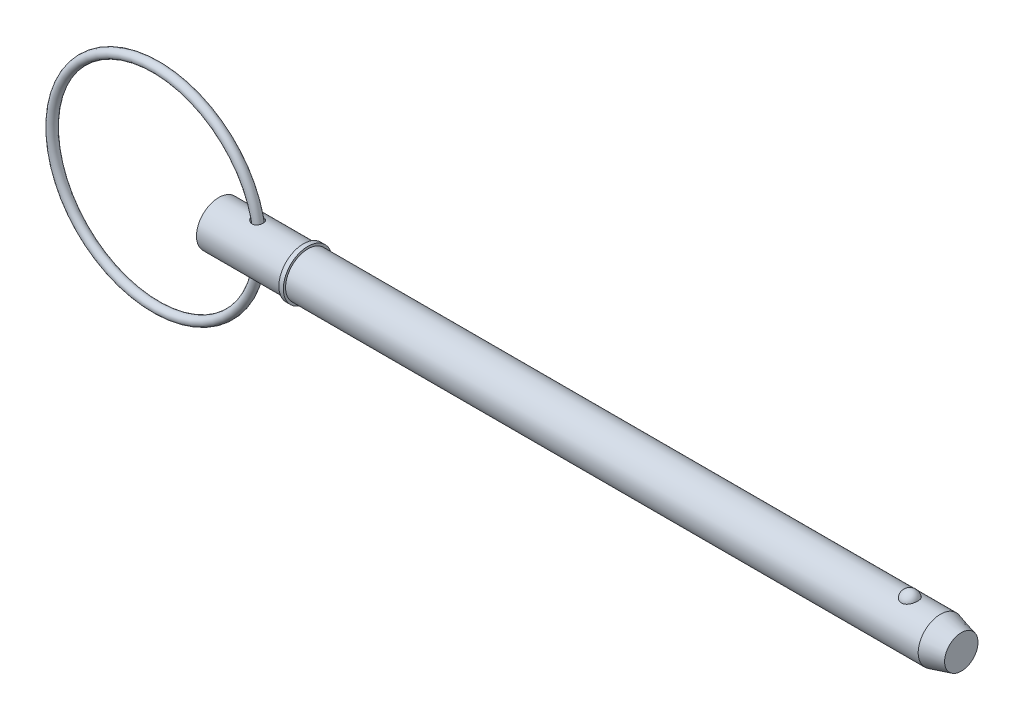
ISO-10303-21;
HEADER;
FILE_DESCRIPTION(('STEP AP214'),'2;1');
FILE_NAME('part.step','',(''),(''),'','','');
FILE_SCHEMA(('AUTOMOTIVE_DESIGN { 1 0 10303 214 1 1 1 1 }'));
ENDSEC;
DATA;
#1=APPLICATION_CONTEXT('core data for automotive mechanical design processes');
#2=APPLICATION_PROTOCOL_DEFINITION('international standard','automotive_design',2000,#1);
#3=PRODUCT_CONTEXT('',#1,'mechanical');
#4=PRODUCT('Part','Part','',(#3));
#5=PRODUCT_RELATED_PRODUCT_CATEGORY('part','',(#4));
#6=PRODUCT_DEFINITION_FORMATION('','',#4);
#7=PRODUCT_DEFINITION_CONTEXT('part definition',#1,'design');
#8=PRODUCT_DEFINITION('design','',#6,#7);
#9=PRODUCT_DEFINITION_SHAPE('','',#8);
#10=(LENGTH_UNIT() NAMED_UNIT(*) SI_UNIT(.MILLI.,.METRE.));
#11=(NAMED_UNIT(*) PLANE_ANGLE_UNIT() SI_UNIT($,.RADIAN.));
#12=(NAMED_UNIT(*) SI_UNIT($,.STERADIAN.) SOLID_ANGLE_UNIT());
#13=UNCERTAINTY_MEASURE_WITH_UNIT(LENGTH_MEASURE(1.E-05),#10,'distance_accuracy_value','');
#14=(GEOMETRIC_REPRESENTATION_CONTEXT(3) GLOBAL_UNCERTAINTY_ASSIGNED_CONTEXT((#13)) GLOBAL_UNIT_ASSIGNED_CONTEXT((#10,
#11,#12)) REPRESENTATION_CONTEXT('',''));
#15=CARTESIAN_POINT('',(0.,0.,0.));
#16=DIRECTION('',(0.,0.,1.));
#17=DIRECTION('',(1.,0.,0.));
#18=AXIS2_PLACEMENT_3D('',#15,#16,#17);
#19=CARTESIAN_POINT('',(-13.4013067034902,0.,0.));
#20=DIRECTION('',(0.,0.,1.));
#21=DIRECTION('',(1.,0.,0.));
#22=AXIS2_PLACEMENT_3D('',#19,#20,#21);
#23=TOROIDAL_SURFACE('',#22,22.225,0.952999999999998);
#24=CARTESIAN_POINT('',(9.77669329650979,0.,0.));
#25=VERTEX_POINT('',#24);
#26=VERTEX_LOOP('',#25);
#27=FACE_BOUND('',#26,.T.);
#28=ADVANCED_FACE('P0_F12',(#27),#23,.T.);
#29=CLOSED_SHELL('',(#28));
#30=MANIFOLD_SOLID_BREP('P0_B1',#29);
#31=CARTESIAN_POINT('',(0.,0.,0.));
#32=DIRECTION('',(1.,0.,0.));
#33=DIRECTION('',(0.,0.,-1.));
#34=AXIS2_PLACEMENT_3D('',#31,#32,#33);
#35=CYLINDRICAL_SURFACE('',#34,4.765);
#36=CARTESIAN_POINT('',(7.31773584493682,4.71580709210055,-0.682926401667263));
#37=CARTESIAN_POINT('',(7.3607471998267,4.70750812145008,-0.740230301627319));
#38=CARTESIAN_POINT('',(7.40883112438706,4.69869300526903,-0.79371122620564));
#39=CARTESIAN_POINT('',(7.51340999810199,4.68106981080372,-0.89180043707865));
#40=CARTESIAN_POINT('',(7.56991882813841,4.67226176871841,-0.936393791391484));
#41=CARTESIAN_POINT('',(7.689548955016,4.65568581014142,-1.01560363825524));
#42=CARTESIAN_POINT('',(7.75265928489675,4.64791621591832,-1.05023633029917));
#43=CARTESIAN_POINT('',(7.88387110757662,4.6343185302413,-1.10870278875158));
#44=CARTESIAN_POINT('',(7.95197058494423,4.62848966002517,-1.13254088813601));
#45=CARTESIAN_POINT('',(8.09209413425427,4.6194749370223,-1.16877415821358));
#46=CARTESIAN_POINT('',(8.16415141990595,4.6163169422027,-1.18104886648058));
#47=CARTESIAN_POINT('',(8.30937958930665,4.61324608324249,-1.19299123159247));
#48=CARTESIAN_POINT('',(8.38255011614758,4.61333220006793,-1.19266284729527));
#49=CARTESIAN_POINT('',(8.52374186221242,4.61674026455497,-1.17939593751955));
#50=CARTESIAN_POINT('',(8.59183022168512,4.61989017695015,-1.16712781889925));
#51=CARTESIAN_POINT('',(8.72470143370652,4.62884731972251,-1.13107903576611));
#52=CARTESIAN_POINT('',(8.78948513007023,4.63465386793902,-1.10730132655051));
#53=CARTESIAN_POINT('',(8.91088768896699,4.64792402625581,-1.05016249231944));
#54=CARTESIAN_POINT('',(8.96774302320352,4.65530108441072,-1.01728198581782));
#55=CARTESIAN_POINT('',(9.07499804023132,4.67102002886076,-0.942471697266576));
#56=CARTESIAN_POINT('',(9.12539777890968,4.6793619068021,-0.900541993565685));
#57=CARTESIAN_POINT('',(9.21836221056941,4.69607497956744,-0.808868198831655));
#58=CARTESIAN_POINT('',(9.26093651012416,4.70444612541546,-0.759133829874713));
#59=CARTESIAN_POINT('',(9.33728390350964,4.72032100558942,-0.653192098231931));
#60=CARTESIAN_POINT('',(9.3710564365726,4.72782468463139,-0.596984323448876));
#61=CARTESIAN_POINT('',(9.42940600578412,4.74126034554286,-0.478808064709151));
#62=CARTESIAN_POINT('',(9.45384681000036,4.74716869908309,-0.416769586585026));
#63=CARTESIAN_POINT('',(9.49226260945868,4.75663465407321,-0.289362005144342));
#64=CARTESIAN_POINT('',(9.50623742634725,4.76019221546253,-0.22399284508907));
#65=CARTESIAN_POINT('',(9.52342004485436,4.76458450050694,-0.0914886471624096));
#66=CARTESIAN_POINT('',(9.52658321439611,4.7654079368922,-0.0243474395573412));
#67=CARTESIAN_POINT('',(9.52194012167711,4.76421136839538,0.109528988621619));
#68=CARTESIAN_POINT('',(9.51413380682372,4.7621913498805,0.176264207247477));
#69=CARTESIAN_POINT('',(9.48775485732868,4.75552896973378,0.307367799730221));
#70=CARTESIAN_POINT('',(9.4691926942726,4.75088915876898,0.371738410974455));
#71=CARTESIAN_POINT('',(9.42175836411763,4.73949008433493,0.496364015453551));
#72=CARTESIAN_POINT('',(9.39288586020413,4.73273075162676,0.556618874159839));
#73=CARTESIAN_POINT('',(9.32549385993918,4.71782154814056,0.671371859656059));
#74=CARTESIAN_POINT('',(9.28696367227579,4.70967013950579,0.725863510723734));
#75=CARTESIAN_POINT('',(9.20123305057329,4.6928883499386,0.827453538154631));
#76=CARTESIAN_POINT('',(9.15403300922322,4.68425799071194,0.874552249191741));
#77=CARTESIAN_POINT('',(9.05250467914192,4.66754854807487,0.959736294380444));
#78=CARTESIAN_POINT('',(8.99822095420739,4.65946646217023,0.997874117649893));
#79=CARTESIAN_POINT('',(8.88381123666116,4.64472049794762,1.06440739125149));
#80=CARTESIAN_POINT('',(8.82368614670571,4.63805640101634,1.09280434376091));
#81=CARTESIAN_POINT('',(8.70022952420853,4.62698068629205,1.13878427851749));
#82=CARTESIAN_POINT('',(8.63695594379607,4.62253830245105,1.15651569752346));
#83=CARTESIAN_POINT('',(8.50825296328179,4.61622454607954,1.18146656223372));
#84=CARTESIAN_POINT('',(8.44282353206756,4.61435321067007,1.18868585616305));
#85=CARTESIAN_POINT('',(8.31119087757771,4.61332122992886,1.19268442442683));
#86=CARTESIAN_POINT('',(8.24498542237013,4.61417920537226,1.18939198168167));
#87=CARTESIAN_POINT('',(8.11397487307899,4.61847671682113,1.17259121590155));
#88=CARTESIAN_POINT('',(8.04917011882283,4.62191687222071,1.15908044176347));
#89=CARTESIAN_POINT('',(7.91946226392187,4.63117528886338,1.12153047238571));
#90=CARTESIAN_POINT('',(7.85470460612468,4.6371000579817,1.09701575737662));
#91=CARTESIAN_POINT('',(7.7300035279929,4.65063246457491,1.03814807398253));
#92=CARTESIAN_POINT('',(7.67006197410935,4.65824075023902,1.00379131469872));
#93=CARTESIAN_POINT('',(7.55352765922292,4.67473656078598,0.924015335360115));
#94=CARTESIAN_POINT('',(7.49726947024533,4.68366994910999,0.878115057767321));
#95=CARTESIAN_POINT('',(7.39344083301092,4.70144936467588,0.777311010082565));
#96=CARTESIAN_POINT('',(7.34587087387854,4.71029538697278,0.722406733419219));
#97=CARTESIAN_POINT('',(7.26188955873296,4.72669773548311,0.605773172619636));
#98=CARTESIAN_POINT('',(7.22531316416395,4.73427229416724,0.544165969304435));
#99=CARTESIAN_POINT('',(7.16406269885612,4.74732663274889,0.415095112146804));
#100=CARTESIAN_POINT('',(7.13937848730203,4.75280819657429,0.347636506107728));
#101=CARTESIAN_POINT('',(7.10494917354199,4.7605495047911,0.215359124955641));
#102=CARTESIAN_POINT('',(7.09405441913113,4.76305589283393,0.150853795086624));
#103=CARTESIAN_POINT('',(7.08387189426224,4.76539656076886,0.0208839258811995));
#104=CARTESIAN_POINT('',(7.0845805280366,4.76523166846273,-0.0445803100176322));
#105=CARTESIAN_POINT('',(7.09709111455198,4.76236014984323,-0.169693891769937));
#106=CARTESIAN_POINT('',(7.10810913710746,4.75983315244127,-0.229428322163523));
#107=CARTESIAN_POINT('',(7.13959099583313,4.75276726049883,-0.346187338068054));
#108=CARTESIAN_POINT('',(7.16004881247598,4.7482296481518,-0.403213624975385));
#109=CARTESIAN_POINT('',(7.20270325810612,4.73907067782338,-0.498040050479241));
#110=CARTESIAN_POINT('',(7.22286864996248,4.73481668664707,-0.536809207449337));
#111=CARTESIAN_POINT('',(7.26730952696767,4.72570777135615,-0.611832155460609));
#112=CARTESIAN_POINT('',(7.29158512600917,4.72085283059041,-0.64808587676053));
#113=CARTESIAN_POINT('',(7.31773584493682,4.71580709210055,-0.682926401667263));
#114=B_SPLINE_CURVE_WITH_KNOTS('',3,(#36,#37,#38,#39,#40,#41,#42,#43,#44,#45,#46,#47,#48,#49,
#50,#51,#52,#53,#54,#55,#56,#57,#58,#59,#60,#61,#62,#63,#64,#65,#66,#67,#68,#69,#70,#71,#72,#73,
#74,#75,#76,#77,#78,#79,#80,#81,#82,#83,#84,#85,#86,#87,#88,#89,#90,#91,#92,#93,#94,#95,#96,#97,
#98,#99,#100,#101,#102,#103,#104,#105,#106,#107,#108,#109,#110,#111,#112,#113),.UNSPECIFIED.,
.T.,.F.,(4,2,2,2,2,2,2,2,2,2,2,2,2,2,2,2,2,2,2,2,2,2,2,2,2,2,2,2,2,2,2,2,2,2,2,2,2,2,4),(0.,
0.216219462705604,0.432799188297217,0.649024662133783,0.865163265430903,1.08352938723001,
1.30182691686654,1.50853487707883,1.71518978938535,1.91252381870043,2.1098561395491,
2.30694457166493,2.50404555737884,2.70392296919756,2.90380378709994,3.10450875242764,
3.30521468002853,3.5057255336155,3.70624293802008,3.90698330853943,4.10771458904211,
4.30723900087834,4.50673262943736,4.70338139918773,4.90003300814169,5.09802914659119,
5.29607279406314,5.5036500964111,5.7113074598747,5.92972727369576,6.14815938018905,
6.36312650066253,6.57790998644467,6.77325899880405,6.96854747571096,7.15009726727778,
7.33153144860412,7.46298830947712,7.59444881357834),.UNSPECIFIED.);
#115=CARTESIAN_POINT('',(7.31773584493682,4.71580709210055,-0.682926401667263));
#116=VERTEX_POINT('',#115);
#117=EDGE_CURVE('P1_E42',#116,#116,#114,.T.);
#118=ORIENTED_EDGE('',*,*,#117,.T.);
#119=EDGE_LOOP('',(#118));
#120=FACE_BOUND('',#119,.T.);
#121=CARTESIAN_POINT('',(0.,0.,0.));
#122=DIRECTION('',(1.,0.,0.));
#123=DIRECTION('',(0.,0.,-1.));
#124=AXIS2_PLACEMENT_3D('',#121,#122,#123);
#125=CIRCLE('',#124,4.765);
#126=CARTESIAN_POINT('',(0.,0.,-4.765));
#127=VERTEX_POINT('',#126);
#128=EDGE_CURVE('P1_E9',#127,#127,#125,.T.);
#129=ORIENTED_EDGE('',*,*,#128,.T.);
#130=EDGE_LOOP('',(#129));
#131=FACE_BOUND('',#130,.T.);
#132=CARTESIAN_POINT('',(18.097,0.,0.));
#133=DIRECTION('',(1.,0.,0.));
#134=DIRECTION('',(0.,0.,-1.));
#135=AXIS2_PLACEMENT_3D('',#132,#133,#134);
#136=CIRCLE('',#135,4.765);
#137=CARTESIAN_POINT('',(18.097,0.,-4.765));
#138=VERTEX_POINT('',#137);
#139=EDGE_CURVE('P1_E25',#138,#138,#136,.T.);
#140=ORIENTED_EDGE('',*,*,#139,.F.);
#141=EDGE_LOOP('',(#140));
#142=FACE_BOUND('',#141,.T.);
#143=CARTESIAN_POINT('',(7.31773584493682,-4.71580709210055,-0.682926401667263));
#144=CARTESIAN_POINT('',(7.27956054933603,-4.72317282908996,-0.63206220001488));
#145=CARTESIAN_POINT('',(7.24535712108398,-4.7301361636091,-0.578155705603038));
#146=CARTESIAN_POINT('',(7.18611785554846,-4.74256090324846,-0.465352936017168));
#147=CARTESIAN_POINT('',(7.16107836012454,-4.74802290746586,-0.406458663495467));
#148=CARTESIAN_POINT('',(7.12119149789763,-4.75686558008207,-0.284913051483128));
#149=CARTESIAN_POINT('',(7.1063796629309,-4.76023898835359,-0.222249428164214));
#150=CARTESIAN_POINT('',(7.08786546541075,-4.76447177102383,-0.0952170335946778));
#151=CARTESIAN_POINT('',(7.08416018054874,-4.76533180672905,-0.0308487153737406));
#152=CARTESIAN_POINT('',(7.08795686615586,-4.76445764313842,0.0942755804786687));
#153=CARTESIAN_POINT('',(7.09490366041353,-4.762851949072,0.155050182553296));
#154=CARTESIAN_POINT('',(7.11863973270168,-4.75746086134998,0.2745356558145));
#155=CARTESIAN_POINT('',(7.13542953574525,-4.75367535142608,0.333246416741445));
#156=CARTESIAN_POINT('',(7.17817193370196,-4.74430545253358,0.447305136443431));
#157=CARTESIAN_POINT('',(7.20415836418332,-4.73871442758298,0.502639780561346));
#158=CARTESIAN_POINT('',(7.26428068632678,-4.72628508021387,0.608523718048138));
#159=CARTESIAN_POINT('',(7.29841897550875,-4.71944639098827,0.659071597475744));
#160=CARTESIAN_POINT('',(7.37680984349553,-4.70456239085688,0.758311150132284));
#161=CARTESIAN_POINT('',(7.42165519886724,-4.69646426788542,0.806526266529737));
#162=CARTESIAN_POINT('',(7.51828933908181,-4.68032890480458,0.895428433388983));
#163=CARTESIAN_POINT('',(7.57008134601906,-4.67229169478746,0.936111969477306));
#164=CARTESIAN_POINT('',(7.68397204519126,-4.65640659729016,1.01229731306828));
#165=CARTESIAN_POINT('',(7.74657226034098,-4.64863251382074,1.04706751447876));
#166=CARTESIAN_POINT('',(7.87680110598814,-4.6349740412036,1.10596507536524));
#167=CARTESIAN_POINT('',(7.94443054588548,-4.62908995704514,1.13009071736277));
#168=CARTESIAN_POINT('',(8.08402017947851,-4.61989019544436,1.16713943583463));
#169=CARTESIAN_POINT('',(8.15603143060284,-4.61661596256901,1.17988211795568));
#170=CARTESIAN_POINT('',(8.30124697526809,-4.61330446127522,1.1927680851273));
#171=CARTESIAN_POINT('',(8.37445077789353,-4.61326589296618,1.19291642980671));
#172=CARTESIAN_POINT('',(8.51584800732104,-4.61644036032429,1.18056687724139));
#173=CARTESIAN_POINT('',(8.58410302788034,-4.61948317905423,1.16873099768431));
#174=CARTESIAN_POINT('',(8.71738052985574,-4.6282520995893,1.13350536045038));
#175=CARTESIAN_POINT('',(8.78240382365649,-4.63397752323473,1.11011852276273));
#176=CARTESIAN_POINT('',(8.90428519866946,-4.64711877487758,1.05371003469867));
#177=CARTESIAN_POINT('',(8.96138096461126,-4.6544450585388,1.02117932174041));
#178=CARTESIAN_POINT('',(9.06916653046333,-4.6700970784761,0.947021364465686));
#179=CARTESIAN_POINT('',(9.11985639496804,-4.67842280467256,0.905394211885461));
#180=CARTESIAN_POINT('',(9.2134071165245,-4.69513303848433,0.814300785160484));
#181=CARTESIAN_POINT('',(9.25628268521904,-4.70351740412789,0.764849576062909));
#182=CARTESIAN_POINT('',(9.33327173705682,-4.71945185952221,0.659422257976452));
#183=CARTESIAN_POINT('',(9.3673846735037,-4.72700189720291,0.603445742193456));
#184=CARTESIAN_POINT('',(9.42645214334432,-4.74055953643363,0.485673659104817));
#185=CARTESIAN_POINT('',(9.45127042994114,-4.74654383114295,0.423807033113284));
#186=CARTESIAN_POINT('',(9.49046298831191,-4.756182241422,0.296676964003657));
#187=CARTESIAN_POINT('',(9.50483706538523,-4.75983631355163,0.231413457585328));
#188=CARTESIAN_POINT('',(9.52283408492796,-4.76443282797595,0.0990368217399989));
#189=CARTESIAN_POINT('',(9.52641016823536,-4.76536345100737,0.0319169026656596));
#190=CARTESIAN_POINT('',(9.52259067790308,-4.76437893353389,-0.101988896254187));
#191=CARTESIAN_POINT('',(9.5151950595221,-4.76246378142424,-0.168774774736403));
#192=CARTESIAN_POINT('',(9.48962516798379,-4.75599746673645,-0.300048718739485));
#193=CARTESIAN_POINT('',(9.4714615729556,-4.75144891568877,-0.364538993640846));
#194=CARTESIAN_POINT('',(9.42480303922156,-4.74020887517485,-0.489470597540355));
#195=CARTESIAN_POINT('',(9.396307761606,-4.73351731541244,-0.549911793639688));
#196=CARTESIAN_POINT('',(9.32963953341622,-4.71871240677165,-0.665099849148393));
#197=CARTESIAN_POINT('',(9.29145577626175,-4.71059747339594,-0.719840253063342));
#198=CARTESIAN_POINT('',(9.20637695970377,-4.69385254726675,-0.82198328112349));
#199=CARTESIAN_POINT('',(9.15948227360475,-4.68522257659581,-0.869386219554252));
#200=CARTESIAN_POINT('',(9.05849937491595,-4.66847516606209,-0.955233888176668));
#201=CARTESIAN_POINT('',(9.00445430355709,-4.6603550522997,-0.993728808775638));
#202=CARTESIAN_POINT('',(8.8904576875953,-4.64550122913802,-1.06100691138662));
#203=CARTESIAN_POINT('',(8.83050704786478,-4.63876730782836,-1.08979157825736));
#204=CARTESIAN_POINT('',(8.70732873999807,-4.6275305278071,-1.13655620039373));
#205=CARTESIAN_POINT('',(8.64416019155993,-4.62299714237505,-1.15468477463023));
#206=CARTESIAN_POINT('',(8.51559711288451,-4.61649071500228,-1.18043067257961));
#207=CARTESIAN_POINT('',(8.4502025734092,-4.61451768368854,-1.18804795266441));
#208=CARTESIAN_POINT('',(8.31862013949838,-4.61328355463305,-1.19283094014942));
#209=CARTESIAN_POINT('',(8.25242983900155,-4.61403911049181,-1.18993246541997));
#210=CARTESIAN_POINT('',(8.12138461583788,-4.61814057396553,-1.17391149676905));
#211=CARTESIAN_POINT('',(8.0565300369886,-4.62148714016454,-1.16078640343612));
#212=CARTESIAN_POINT('',(7.92669960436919,-4.63056912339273,-1.12402333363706));
#213=CARTESIAN_POINT('',(7.86186447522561,-4.63641051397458,-1.09991536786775));
#214=CARTESIAN_POINT('',(7.73694230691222,-4.64980121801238,-1.04185298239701));
#215=CARTESIAN_POINT('',(7.6768568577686,-4.65735110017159,-1.0078952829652));
#216=CARTESIAN_POINT('',(7.56207884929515,-4.67346080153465,-0.930364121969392));
#217=CARTESIAN_POINT('',(7.5074784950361,-4.68203382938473,-0.886656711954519));
#218=CARTESIAN_POINT('',(7.40624045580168,-4.69916824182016,-0.79082583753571));
#219=CARTESIAN_POINT('',(7.35959988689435,-4.7077296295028,-0.738705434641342));
#220=CARTESIAN_POINT('',(7.31773584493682,-4.71580709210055,-0.682926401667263));
#221=B_SPLINE_CURVE_WITH_KNOTS('',3,(#143,#144,#145,#146,#147,#148,#149,#150,#151,#152,#153,
#154,#155,#156,#157,#158,#159,#160,#161,#162,#163,#164,#165,#166,#167,#168,#169,#170,#171,#172,
#173,#174,#175,#176,#177,#178,#179,#180,#181,#182,#183,#184,#185,#186,#187,#188,#189,#190,#191,
#192,#193,#194,#195,#196,#197,#198,#199,#200,#201,#202,#203,#204,#205,#206,#207,#208,#209,#210,
#211,#212,#213,#214,#215,#216,#217,#218,#219,#220),.UNSPECIFIED.,.T.,.F.,(4,2,2,2,2,2,2,2,2,2,2,
2,2,2,2,2,2,2,2,2,2,2,2,2,2,2,2,2,2,2,2,2,2,2,2,2,2,2,4),(0.,0.191851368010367,0.38362606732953,
0.576063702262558,0.768450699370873,0.951145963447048,1.13385097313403,1.31723528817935,
1.50067360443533,1.69887079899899,1.8971602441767,2.11225870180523,2.32739185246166,
2.54587681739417,2.76427400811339,2.97123130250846,3.17813630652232,3.37555441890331,
3.57297054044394,3.77001106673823,3.96706388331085,4.16690159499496,4.36674303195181,
4.56745046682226,4.76815872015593,4.96866827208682,5.16918440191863,5.36992517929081,
5.5706573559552,5.77022940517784,5.96977092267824,6.16645904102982,6.36314797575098,
6.56103940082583,6.75898114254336,6.96633026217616,7.17374850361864,7.384214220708,
7.59460352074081),.UNSPECIFIED.);
#222=CARTESIAN_POINT('',(7.31773584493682,-4.71580709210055,-0.682926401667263));
#223=VERTEX_POINT('',#222);
#224=EDGE_CURVE('P1_E17',#223,#223,#221,.T.);
#225=ORIENTED_EDGE('',*,*,#224,.T.);
#226=EDGE_LOOP('',(#225));
#227=FACE_BOUND('',#226,.T.);
#228=ADVANCED_FACE('P1_F13',(#120,#131,#142,#227),#35,.T.);
#229=CARTESIAN_POINT('',(0.,0.,0.));
#230=DIRECTION('',(1.,0.,0.));
#231=DIRECTION('',(0.,0.,-1.));
#232=AXIS2_PLACEMENT_3D('',#229,#230,#231);
#233=CYLINDRICAL_SURFACE('',#232,4.765);
#234=CARTESIAN_POINT('',(154.304194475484,0.,0.));
#235=DIRECTION('',(1.,0.,0.));
#236=DIRECTION('',(0.,0.,-1.));
#237=AXIS2_PLACEMENT_3D('',#234,#235,#236);
#238=CIRCLE('',#237,4.765);
#239=CARTESIAN_POINT('',(154.304194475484,0.,-4.765));
#240=VERTEX_POINT('',#239);
#241=EDGE_CURVE('P1_E99',#240,#240,#238,.T.);
#242=ORIENTED_EDGE('',*,*,#241,.F.);
#243=EDGE_LOOP('',(#242));
#244=FACE_BOUND('',#243,.T.);
#245=CARTESIAN_POINT('',(19.05,0.,0.));
#246=DIRECTION('',(1.,0.,0.));
#247=DIRECTION('',(0.,0.,-1.));
#248=AXIS2_PLACEMENT_3D('',#245,#246,#247);
#249=CIRCLE('',#248,4.765);
#250=CARTESIAN_POINT('',(19.05,0.,-4.765));
#251=VERTEX_POINT('',#250);
#252=EDGE_CURVE('P1_E96',#251,#251,#249,.T.);
#253=ORIENTED_EDGE('',*,*,#252,.T.);
#254=EDGE_LOOP('',(#253));
#255=FACE_BOUND('',#254,.T.);
#256=CARTESIAN_POINT('',(147.751020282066,4.42764777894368,1.76101111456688));
#257=CARTESIAN_POINT('',(147.659721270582,4.42764470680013,1.76101422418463));
#258=CARTESIAN_POINT('',(147.568446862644,4.43059091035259,1.75366340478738));
#259=CARTESIAN_POINT('',(147.388615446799,4.44201846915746,1.72451180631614));
#260=CARTESIAN_POINT('',(147.300057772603,4.45049845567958,1.70271460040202));
#261=CARTESIAN_POINT('',(147.128257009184,4.47200516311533,1.64539370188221));
#262=CARTESIAN_POINT('',(147.045006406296,4.48502527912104,1.60988994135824));
#263=CARTESIAN_POINT('',(146.885763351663,4.51419542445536,1.52617873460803));
#264=CARTESIAN_POINT('',(146.809772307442,4.53034605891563,1.47796883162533));
#265=CARTESIAN_POINT('',(146.664744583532,4.56459317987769,1.36860494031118));
#266=CARTESIAN_POINT('',(146.595964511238,4.58273170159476,1.30712420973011));
#267=CARTESIAN_POINT('',(146.469342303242,4.61870302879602,1.17370204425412));
#268=CARTESIAN_POINT('',(146.411502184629,4.63653577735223,1.10175868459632));
#269=CARTESIAN_POINT('',(146.305570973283,4.67090140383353,0.945806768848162));
#270=CARTESIAN_POINT('',(146.258030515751,4.68734068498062,0.861402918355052));
#271=CARTESIAN_POINT('',(146.177081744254,4.71628466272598,0.685442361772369));
#272=CARTESIAN_POINT('',(146.143674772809,4.72878898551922,0.593884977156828));
#273=CARTESIAN_POINT('',(146.091287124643,4.74874061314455,0.404781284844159));
#274=CARTESIAN_POINT('',(146.072517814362,4.75611366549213,0.307168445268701));
#275=CARTESIAN_POINT('',(146.050584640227,4.76475393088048,0.109940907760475));
#276=CARTESIAN_POINT('',(146.047420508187,4.76602124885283,0.0103262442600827));
#277=CARTESIAN_POINT('',(146.056740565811,4.76232928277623,-0.187629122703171));
#278=CARTESIAN_POINT('',(146.069158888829,4.7573962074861,-0.285973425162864));
#279=CARTESIAN_POINT('',(146.109280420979,4.74184975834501,-0.479027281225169));
#280=CARTESIAN_POINT('',(146.136983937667,4.7312362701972,-0.573736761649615));
#281=CARTESIAN_POINT('',(146.207158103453,4.70540026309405,-0.756973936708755));
#282=CARTESIAN_POINT('',(146.249646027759,4.69017235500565,-0.845494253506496));
#283=CARTESIAN_POINT('',(146.348520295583,4.6566986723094,-1.01378033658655));
#284=CARTESIAN_POINT('',(146.404907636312,4.63845268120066,-1.09354547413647));
#285=CARTESIAN_POINT('',(146.530552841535,4.60085438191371,-1.24228523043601));
#286=CARTESIAN_POINT('',(146.599843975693,4.58149930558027,-1.31123108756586));
#287=CARTESIAN_POINT('',(146.749606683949,4.54391653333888,-1.43607409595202));
#288=CARTESIAN_POINT('',(146.830077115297,4.52568872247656,-1.49197257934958));
#289=CARTESIAN_POINT('',(146.998150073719,4.49293007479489,-1.58786764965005));
#290=CARTESIAN_POINT('',(147.085544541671,4.47832346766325,-1.62820219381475));
#291=CARTESIAN_POINT('',(147.266553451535,4.45406011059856,-1.69345757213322));
#292=CARTESIAN_POINT('',(147.36016555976,4.44440151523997,-1.71838415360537));
#293=CARTESIAN_POINT('',(147.545893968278,4.43159888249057,-1.75112843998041));
#294=CARTESIAN_POINT('',(147.637849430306,4.42815213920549,-1.75974223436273));
#295=CARTESIAN_POINT('',(147.821965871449,4.427247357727,-1.76201865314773));
#296=CARTESIAN_POINT('',(147.914126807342,4.42978816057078,-1.7556841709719));
#297=CARTESIAN_POINT('',(148.093129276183,4.44038648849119,-1.72869560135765));
#298=CARTESIAN_POINT('',(148.180047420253,4.44827555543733,-1.70847853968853));
#299=CARTESIAN_POINT('',(148.349131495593,4.46852246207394,-1.65479562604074));
#300=CARTESIAN_POINT('',(148.431297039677,4.48088066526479,-1.62132869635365));
#301=CARTESIAN_POINT('',(148.590591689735,4.50907357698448,-1.54120560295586));
#302=CARTESIAN_POINT('',(148.667570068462,4.52497884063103,-1.49427526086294));
#303=CARTESIAN_POINT('',(148.812708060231,4.55845148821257,-1.38881222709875));
#304=CARTESIAN_POINT('',(148.880865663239,4.57601924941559,-1.33027689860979));
#305=CARTESIAN_POINT('',(149.010099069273,4.61196537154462,-1.1999104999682));
#306=CARTESIAN_POINT('',(149.070656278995,4.63034074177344,-1.12756415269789));
#307=CARTESIAN_POINT('',(149.179279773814,4.66513959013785,-0.97361299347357));
#308=CARTESIAN_POINT('',(149.227343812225,4.68156271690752,-0.892006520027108));
#309=CARTESIAN_POINT('',(149.311383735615,4.71130224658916,-0.718892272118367));
#310=CARTESIAN_POINT('',(149.346918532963,4.724501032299,-0.62714967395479));
#311=CARTESIAN_POINT('',(149.402952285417,4.74571823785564,-0.438611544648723));
#312=CARTESIAN_POINT('',(149.423450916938,4.75373654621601,-0.341815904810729));
#313=CARTESIAN_POINT('',(149.449033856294,4.76378905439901,-0.14563306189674));
#314=CARTESIAN_POINT('',(149.454076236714,4.76580697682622,-0.0462395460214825));
#315=CARTESIAN_POINT('',(149.448523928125,4.7636057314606,0.152038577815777));
#316=CARTESIAN_POINT('',(149.437929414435,4.75938663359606,0.250923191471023));
#317=CARTESIAN_POINT('',(149.401387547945,4.74516937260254,0.4450044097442));
#318=CARTESIAN_POINT('',(149.375496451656,4.73519238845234,0.540213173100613));
#319=CARTESIAN_POINT('',(149.308927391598,4.71049394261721,0.72466221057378));
#320=CARTESIAN_POINT('',(149.268248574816,4.69577220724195,0.813902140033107));
#321=CARTESIAN_POINT('',(149.172717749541,4.66303767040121,0.984313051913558));
#322=CARTESIAN_POINT('',(149.117804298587,4.64501070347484,1.06544688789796));
#323=CARTESIAN_POINT('',(148.995049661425,4.60764678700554,1.21692673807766));
#324=CARTESIAN_POINT('',(148.927208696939,4.58830985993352,1.28727293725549));
#325=CARTESIAN_POINT('',(148.780548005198,4.55060370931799,1.41479271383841));
#326=CARTESIAN_POINT('',(148.701791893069,4.53222967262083,1.47203785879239));
#327=CARTESIAN_POINT('',(148.534989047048,4.49849576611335,1.57212016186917));
#328=CARTESIAN_POINT('',(148.446941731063,4.48313608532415,1.6149564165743));
#329=CARTESIAN_POINT('',(148.259791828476,4.45676184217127,1.68642657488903));
#330=CARTESIAN_POINT('',(148.160365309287,4.44598302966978,1.71430590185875));
#331=CARTESIAN_POINT('',(147.957621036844,4.43142918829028,1.75159258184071));
#332=CARTESIAN_POINT('',(147.854304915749,4.42765125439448,1.76100759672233));
#333=CARTESIAN_POINT('',(147.751020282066,4.42764777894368,1.76101111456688));
#334=B_SPLINE_CURVE_WITH_KNOTS('',3,(#256,#257,#258,#259,#260,#261,#262,#263,#264,#265,#266,
#267,#268,#269,#270,#271,#272,#273,#274,#275,#276,#277,#278,#279,#280,#281,#282,#283,#284,#285,
#286,#287,#288,#289,#290,#291,#292,#293,#294,#295,#296,#297,#298,#299,#300,#301,#302,#303,#304,
#305,#306,#307,#308,#309,#310,#311,#312,#313,#314,#315,#316,#317,#318,#319,#320,#321,#322,#323,
#324,#325,#326,#327,#328,#329,#330,#331,#332,#333),.UNSPECIFIED.,.T.,.F.,(4,2,2,2,2,2,2,2,2,2,2,
2,2,2,2,2,2,2,2,2,2,2,2,2,2,2,2,2,2,2,2,2,2,2,2,2,2,2,4),(0.,0.273517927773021,
0.546968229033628,0.820022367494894,1.09312934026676,1.37393946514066,1.6548013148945,
1.94820420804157,2.24163496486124,2.53922817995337,2.83681628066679,3.13315071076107,
3.42949110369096,3.72617893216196,4.02288805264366,4.32037303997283,4.61782764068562,
4.9084009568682,5.19886582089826,5.47474855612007,5.75057789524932,6.0180997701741,
6.28564340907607,6.55907787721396,6.83257454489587,7.11962987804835,7.40673679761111,
7.70312663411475,7.9995228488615,8.29672237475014,8.59391856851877,8.89002850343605,
9.18615552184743,9.483582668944,9.7810047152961,10.0767610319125,10.3725358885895,
10.6820893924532,10.991514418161),.UNSPECIFIED.);
#335=CARTESIAN_POINT('',(147.751020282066,4.42764777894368,1.76101111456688));
#336=VERTEX_POINT('',#335);
#337=EDGE_CURVE('P1_E34',#336,#336,#334,.T.);
#338=ORIENTED_EDGE('',*,*,#337,.T.);
#339=EDGE_LOOP('',(#338));
#340=FACE_BOUND('',#339,.T.);
#341=ADVANCED_FACE('P1_F46',(#244,#255,#340),#233,.T.);
#342=CARTESIAN_POINT('',(0.,0.,0.));
#343=DIRECTION('',(-1.,0.,0.));
#344=DIRECTION('',(0.,0.,1.));
#345=AXIS2_PLACEMENT_3D('',#342,#343,#344);
#346=PLANE('',#345);
#347=ORIENTED_EDGE('',*,*,#128,.F.);
#348=EDGE_LOOP('',(#347));
#349=FACE_BOUND('',#348,.T.);
#350=ADVANCED_FACE('P1_F15',(#349),#346,.T.);
#351=CARTESIAN_POINT('',(18.097,4.765,0.));
#352=DIRECTION('',(-1.,0.,0.));
#353=DIRECTION('',(0.,0.,1.));
#354=AXIS2_PLACEMENT_3D('',#351,#352,#353);
#355=PLANE('',#354);
#356=ORIENTED_EDGE('',*,*,#139,.T.);
#357=EDGE_LOOP('',(#356));
#358=FACE_BOUND('',#357,.T.);
#359=CARTESIAN_POINT('',(18.097,0.,0.));
#360=DIRECTION('',(1.,0.,0.));
#361=DIRECTION('',(0.,0.,-1.));
#362=AXIS2_PLACEMENT_3D('',#359,#360,#361);
#363=CIRCLE('',#362,5.2415);
#364=CARTESIAN_POINT('',(18.097,0.,-5.2415));
#365=VERTEX_POINT('',#364);
#366=EDGE_CURVE('P1_E30',#365,#365,#363,.T.);
#367=ORIENTED_EDGE('',*,*,#366,.F.);
#368=EDGE_LOOP('',(#367));
#369=FACE_BOUND('',#368,.T.);
#370=ADVANCED_FACE('P1_F81',(#358,#369),#355,.T.);
#371=CARTESIAN_POINT('',(0.,0.,0.));
#372=DIRECTION('',(1.,0.,0.));
#373=DIRECTION('',(0.,0.,-1.));
#374=AXIS2_PLACEMENT_3D('',#371,#372,#373);
#375=CYLINDRICAL_SURFACE('',#374,5.2415);
#376=ORIENTED_EDGE('',*,*,#366,.T.);
#377=EDGE_LOOP('',(#376));
#378=FACE_BOUND('',#377,.T.);
#379=CARTESIAN_POINT('',(19.05,0.,0.));
#380=DIRECTION('',(1.,0.,0.));
#381=DIRECTION('',(0.,0.,-1.));
#382=AXIS2_PLACEMENT_3D('',#379,#380,#381);
#383=CIRCLE('',#382,5.2415);
#384=CARTESIAN_POINT('',(19.05,0.,-5.2415));
#385=VERTEX_POINT('',#384);
#386=EDGE_CURVE('P1_E95',#385,#385,#383,.T.);
#387=ORIENTED_EDGE('',*,*,#386,.F.);
#388=EDGE_LOOP('',(#387));
#389=FACE_BOUND('',#388,.T.);
#390=ADVANCED_FACE('P1_F68',(#378,#389),#375,.T.);
#391=CARTESIAN_POINT('',(19.05,5.2415,0.));
#392=DIRECTION('',(1.,0.,0.));
#393=DIRECTION('',(0.,0.,-1.));
#394=AXIS2_PLACEMENT_3D('',#391,#392,#393);
#395=PLANE('',#394);
#396=ORIENTED_EDGE('',*,*,#386,.T.);
#397=EDGE_LOOP('',(#396));
#398=FACE_BOUND('',#397,.T.);
#399=ORIENTED_EDGE('',*,*,#252,.F.);
#400=EDGE_LOOP('',(#399));
#401=FACE_BOUND('',#400,.T.);
#402=ADVANCED_FACE('P1_F62',(#398,#401),#395,.T.);
#403=CARTESIAN_POINT('',(158.75,0.,0.));
#404=DIRECTION('',(-1.,0.,0.));
#405=DIRECTION('',(0.,0.,1.));
#406=AXIS2_PLACEMENT_3D('',#403,#404,#405);
#407=CONICAL_SURFACE('',#406,3.57375000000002,0.26179938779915);
#408=ORIENTED_EDGE('',*,*,#241,.T.);
#409=EDGE_LOOP('',(#408));
#410=FACE_BOUND('',#409,.T.);
#411=CARTESIAN_POINT('',(158.75,0.,0.));
#412=DIRECTION('',(1.,0.,0.));
#413=DIRECTION('',(0.,0.,-1.));
#414=AXIS2_PLACEMENT_3D('',#411,#412,#413);
#415=CIRCLE('',#414,3.57375000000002);
#416=CARTESIAN_POINT('',(158.75,0.,-3.57375000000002));
#417=VERTEX_POINT('',#416);
#418=EDGE_CURVE('P1_E41',#417,#417,#415,.T.);
#419=ORIENTED_EDGE('',*,*,#418,.F.);
#420=EDGE_LOOP('',(#419));
#421=FACE_BOUND('',#420,.T.);
#422=ADVANCED_FACE('P1_F59',(#410,#421),#407,.T.);
#423=CARTESIAN_POINT('',(158.75,3.57375000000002,0.));
#424=DIRECTION('',(1.,0.,0.));
#425=DIRECTION('',(0.,0.,-1.));
#426=AXIS2_PLACEMENT_3D('',#423,#424,#425);
#427=PLANE('',#426);
#428=ORIENTED_EDGE('',*,*,#418,.T.);
#429=EDGE_LOOP('',(#428));
#430=FACE_BOUND('',#429,.T.);
#431=ADVANCED_FACE('P1_F55',(#430),#427,.T.);
#432=CARTESIAN_POINT('',(147.751020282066,4.2885,0.));
#433=DIRECTION('',(-1.,0.,0.));
#434=DIRECTION('',(0.,-1.,0.));
#435=AXIS2_PLACEMENT_3D('',#432,#433,#434);
#436=SPHERICAL_SURFACE('',#435,1.7665);
#437=ORIENTED_EDGE('',*,*,#337,.F.);
#438=EDGE_LOOP('',(#437));
#439=FACE_BOUND('',#438,.T.);
#440=ADVANCED_FACE('P1_F50',(#439),#436,.T.);
#441=CARTESIAN_POINT('',(-13.4013067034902,0.,0.));
#442=DIRECTION('',(0.,0.,1.));
#443=DIRECTION('',(1.,0.,0.));
#444=AXIS2_PLACEMENT_3D('',#441,#442,#443);
#445=TOROIDAL_SURFACE('',#444,22.225,1.19125);
#446=ORIENTED_EDGE('',*,*,#224,.F.);
#447=EDGE_LOOP('',(#446));
#448=FACE_BOUND('',#447,.T.);
#449=ORIENTED_EDGE('',*,*,#117,.F.);
#450=EDGE_LOOP('',(#449));
#451=FACE_BOUND('',#450,.T.);
#452=ADVANCED_FACE('P1_F54',(#448,#451),#445,.F.);
#453=CLOSED_SHELL('',(#228,#341,#350,#370,#390,#402,#422,#431,#440,#452));
#454=MANIFOLD_SOLID_BREP('P1_B1',#453);
#455=ADVANCED_BREP_SHAPE_REPRESENTATION('',(#18,#30,#454),#14);
#456=SHAPE_DEFINITION_REPRESENTATION(#9,#455);
ENDSEC;
END-ISO-10303-21;
